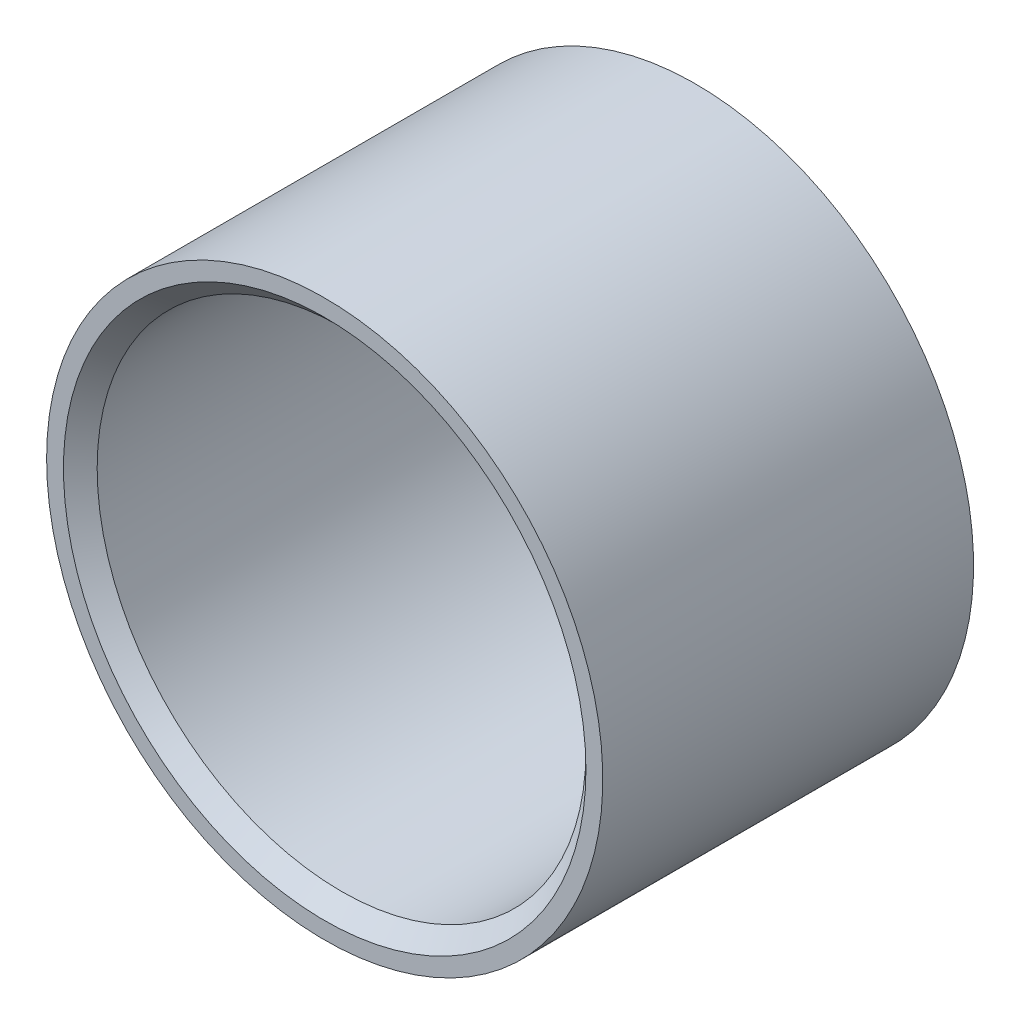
ISO-10303-21;
HEADER;
FILE_DESCRIPTION(('STEP AP214'),'2;1');
FILE_NAME('part.step','',(''),(''),'','','');
FILE_SCHEMA(('AUTOMOTIVE_DESIGN { 1 0 10303 214 1 1 1 1 }'));
ENDSEC;
DATA;
#1=APPLICATION_CONTEXT('core data for automotive mechanical design processes');
#2=APPLICATION_PROTOCOL_DEFINITION('international standard','automotive_design',2000,#1);
#3=PRODUCT_CONTEXT('',#1,'mechanical');
#4=PRODUCT('Part','Part','',(#3));
#5=PRODUCT_RELATED_PRODUCT_CATEGORY('part','',(#4));
#6=PRODUCT_DEFINITION_FORMATION('','',#4);
#7=PRODUCT_DEFINITION_CONTEXT('part definition',#1,'design');
#8=PRODUCT_DEFINITION('design','',#6,#7);
#9=PRODUCT_DEFINITION_SHAPE('','',#8);
#10=(LENGTH_UNIT() NAMED_UNIT(*) SI_UNIT(.MILLI.,.METRE.));
#11=(NAMED_UNIT(*) PLANE_ANGLE_UNIT() SI_UNIT($,.RADIAN.));
#12=(NAMED_UNIT(*) SI_UNIT($,.STERADIAN.) SOLID_ANGLE_UNIT());
#13=UNCERTAINTY_MEASURE_WITH_UNIT(LENGTH_MEASURE(1.E-05),#10,'distance_accuracy_value','');
#14=(GEOMETRIC_REPRESENTATION_CONTEXT(3) GLOBAL_UNCERTAINTY_ASSIGNED_CONTEXT((#13)) GLOBAL_UNIT_ASSIGNED_CONTEXT((#10,
#11,#12)) REPRESENTATION_CONTEXT('',''));
#15=CARTESIAN_POINT('',(0.,0.,0.));
#16=DIRECTION('',(0.,0.,1.));
#17=DIRECTION('',(1.,0.,0.));
#18=AXIS2_PLACEMENT_3D('',#15,#16,#17);
#19=CARTESIAN_POINT('',(-6.80391308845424,0.438281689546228,0.));
#20=DIRECTION('',(0.,0.,-1.));
#21=DIRECTION('',(-1.,0.,0.));
#22=AXIS2_PLACEMENT_3D('',#19,#20,#21);
#23=CYLINDRICAL_SURFACE('',#22,14.5);
#24=CARTESIAN_POINT('',(-6.80391308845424,0.438281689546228,-22.));
#25=DIRECTION('',(0.,0.,-1.));
#26=DIRECTION('',(-1.,0.,0.));
#27=AXIS2_PLACEMENT_3D('',#24,#25,#26);
#28=CIRCLE('',#27,14.5);
#29=CARTESIAN_POINT('',(-21.3039130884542,0.438281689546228,-22.));
#30=VERTEX_POINT('',#29);
#31=EDGE_CURVE('E19',#30,#30,#28,.T.);
#32=ORIENTED_EDGE('',*,*,#31,.T.);
#33=EDGE_LOOP('',(#32));
#34=FACE_BOUND('',#33,.T.);
#35=CARTESIAN_POINT('',(-6.80391308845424,0.438281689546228,-1.));
#36=DIRECTION('',(0.,0.,1.));
#37=DIRECTION('',(-1.,0.,0.));
#38=AXIS2_PLACEMENT_3D('',#35,#36,#37);
#39=CIRCLE('',#38,14.5);
#40=CARTESIAN_POINT('',(-21.3039130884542,0.438281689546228,-1.));
#41=VERTEX_POINT('',#40);
#42=EDGE_CURVE('E31',#41,#41,#39,.F.);
#43=ORIENTED_EDGE('',*,*,#42,.F.);
#44=EDGE_LOOP('',(#43));
#45=FACE_BOUND('',#44,.T.);
#46=ADVANCED_FACE('F15',(#34,#45),#23,.F.);
#47=CARTESIAN_POINT('',(-6.80391308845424,0.438281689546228,-1.));
#48=DIRECTION('',(0.,0.,1.));
#49=DIRECTION('',(1.,0.,0.));
#50=AXIS2_PLACEMENT_3D('',#47,#48,#49);
#51=CONICAL_SURFACE('',#50,14.5,0.785398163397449);
#52=ORIENTED_EDGE('',*,*,#42,.T.);
#53=EDGE_LOOP('',(#52));
#54=FACE_BOUND('',#53,.T.);
#55=CARTESIAN_POINT('',(-6.80391308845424,0.438281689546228,0.));
#56=DIRECTION('',(0.,0.,1.));
#57=DIRECTION('',(1.,0.,0.));
#58=AXIS2_PLACEMENT_3D('',#55,#56,#57);
#59=CIRCLE('',#58,15.5);
#60=CARTESIAN_POINT('',(8.69608691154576,0.438281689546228,0.));
#61=VERTEX_POINT('',#60);
#62=EDGE_CURVE('E28',#61,#61,#59,.T.);
#63=ORIENTED_EDGE('',*,*,#62,.T.);
#64=EDGE_LOOP('',(#63));
#65=FACE_BOUND('',#64,.T.);
#66=ADVANCED_FACE('F41',(#54,#65),#51,.F.);
#67=CARTESIAN_POINT('',(-6.80391308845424,0.438281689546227,-22.));
#68=DIRECTION('',(0.,0.,1.));
#69=DIRECTION('',(0.,-1.,0.));
#70=AXIS2_PLACEMENT_3D('',#67,#68,#69);
#71=PLANE('',#70);
#72=CARTESIAN_POINT('',(-6.80391308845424,0.438281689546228,-22.));
#73=DIRECTION('',(0.,0.,-1.));
#74=DIRECTION('',(-1.,0.,0.));
#75=AXIS2_PLACEMENT_3D('',#72,#73,#74);
#76=CIRCLE('',#75,16.5);
#77=CARTESIAN_POINT('',(-23.3039130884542,0.438281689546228,-22.));
#78=VERTEX_POINT('',#77);
#79=EDGE_CURVE('E23',#78,#78,#76,.F.);
#80=ORIENTED_EDGE('',*,*,#79,.F.);
#81=EDGE_LOOP('',(#80));
#82=FACE_BOUND('',#81,.T.);
#83=ORIENTED_EDGE('',*,*,#31,.F.);
#84=EDGE_LOOP('',(#83));
#85=FACE_BOUND('',#84,.T.);
#86=ADVANCED_FACE('F49',(#82,#85),#71,.F.);
#87=CARTESIAN_POINT('',(-6.80391308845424,0.438281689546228,0.));
#88=DIRECTION('',(0.,0.,-1.));
#89=DIRECTION('',(-1.,0.,0.));
#90=AXIS2_PLACEMENT_3D('',#87,#88,#89);
#91=PLANE('',#90);
#92=ORIENTED_EDGE('',*,*,#62,.F.);
#93=EDGE_LOOP('',(#92));
#94=FACE_BOUND('',#93,.T.);
#95=CARTESIAN_POINT('',(-6.80391308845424,0.438281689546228,0.));
#96=DIRECTION('',(0.,0.,-1.));
#97=DIRECTION('',(-1.,0.,0.));
#98=AXIS2_PLACEMENT_3D('',#95,#96,#97);
#99=CIRCLE('',#98,16.5);
#100=CARTESIAN_POINT('',(-23.3039130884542,0.438281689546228,0.));
#101=VERTEX_POINT('',#100);
#102=EDGE_CURVE('E10',#101,#101,#99,.T.);
#103=ORIENTED_EDGE('',*,*,#102,.F.);
#104=EDGE_LOOP('',(#103));
#105=FACE_BOUND('',#104,.T.);
#106=ADVANCED_FACE('F52',(#94,#105),#91,.F.);
#107=CARTESIAN_POINT('',(-6.80391308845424,0.438281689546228,0.));
#108=DIRECTION('',(0.,0.,-1.));
#109=DIRECTION('',(-1.,0.,0.));
#110=AXIS2_PLACEMENT_3D('',#107,#108,#109);
#111=CYLINDRICAL_SURFACE('',#110,16.5);
#112=ORIENTED_EDGE('',*,*,#79,.T.);
#113=EDGE_LOOP('',(#112));
#114=FACE_BOUND('',#113,.T.);
#115=ORIENTED_EDGE('',*,*,#102,.T.);
#116=EDGE_LOOP('',(#115));
#117=FACE_BOUND('',#116,.T.);
#118=ADVANCED_FACE('F17',(#114,#117),#111,.T.);
#119=CLOSED_SHELL('',(#46,#66,#86,#106,#118));
#120=MANIFOLD_SOLID_BREP('B1',#119);
#121=ADVANCED_BREP_SHAPE_REPRESENTATION('',(#18,#120),#14);
#122=SHAPE_DEFINITION_REPRESENTATION(#9,#121);
ENDSEC;
END-ISO-10303-21;
